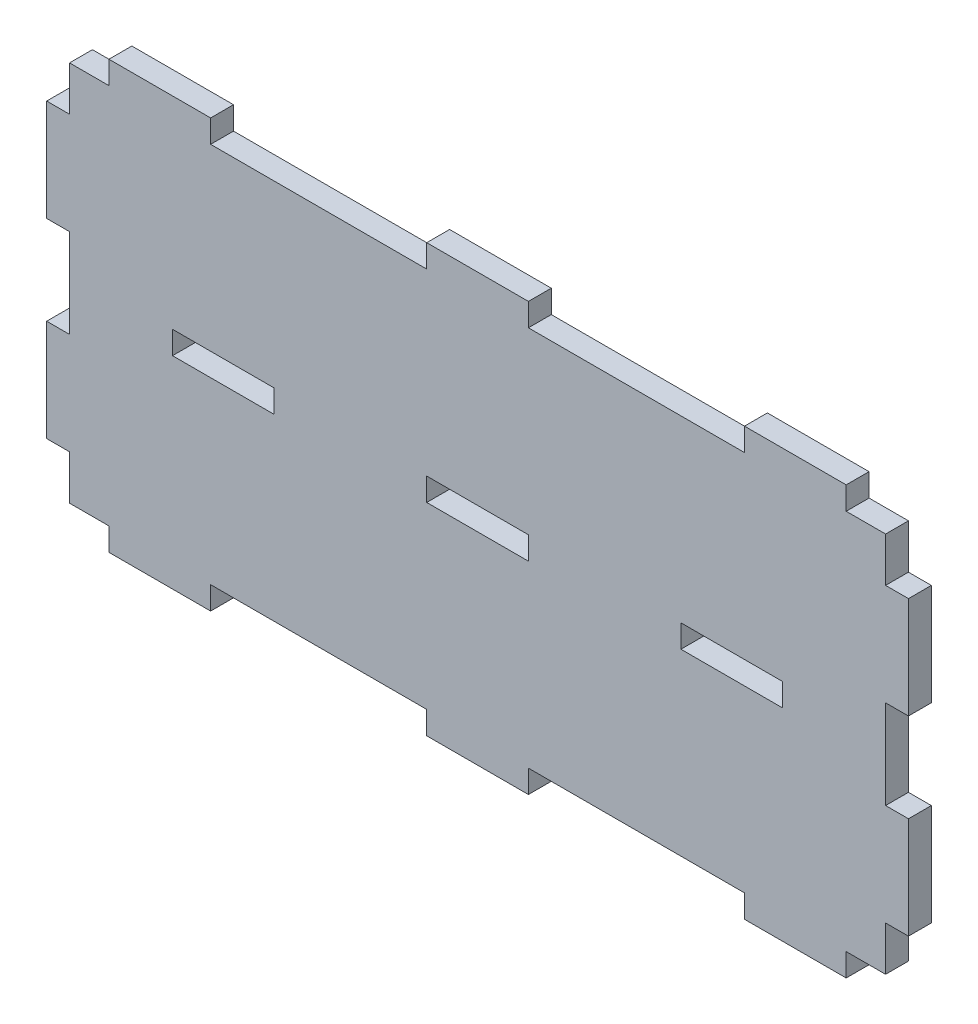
from build123d import *

# Parameters (mm, degrees)
SCHIZZO1_W                   = 642
SCHIZZO1_H                   = 300
ESTRUSIONE_ESTRUSIONE1_DEPTH = 18
SCHIZZO2_W                   = 80
SCHIZZO2_H                   = 18
ESTRUSIONE_ESTRUSIONE2_DEPTH = 18
SCHIZZO3_W                   = 18
SCHIZZO3_H                   = 80
ESTRUSIONE_ESTRUSIONE3_DEPTH = 18
SCHIZZO4_W                   = 80
SCHIZZO4_H                   = 18
TAGLIO_ESTRUSIONE1_DEPTH     = 379.773019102


with BuildPart() as part:
    # Schizzo1 → Estrusione-Estrusione1 (new body)
    with BuildSketch(Plane.XY):
        Rectangle(SCHIZZO1_W, SCHIZZO1_H)
    extrude(amount=ESTRUSIONE_ESTRUSIONE1_DEPTH)

    # Schizzo2 → Estrusione-Estrusione2 (add)
    with BuildSketch(Plane.XY.offset(18)):
        with Locations((-250, -159)):
            Rectangle(SCHIZZO2_W, SCHIZZO2_H)
        with Locations((250, -159)):
            Rectangle(SCHIZZO2_W, SCHIZZO2_H)
        with Locations((0, -159)):
            Rectangle(SCHIZZO2_W, SCHIZZO2_H)
        with Locations((0, 159)):
            Rectangle(SCHIZZO2_W, SCHIZZO2_H)
        with Locations((250, 159)):
            Rectangle(SCHIZZO2_W, SCHIZZO2_H)
        with Locations((-250, 159)):
            Rectangle(SCHIZZO2_W, SCHIZZO2_H)
    extrude(amount=-ESTRUSIONE_ESTRUSIONE2_DEPTH)

    # Schizzo3 → Estrusione-Estrusione3 (add)
    with BuildSketch(Plane.XY.offset(18)):
        with Locations((-330, 75)):
            Rectangle(SCHIZZO3_W, SCHIZZO3_H)
        with Locations((-330, -75)):
            Rectangle(SCHIZZO3_W, SCHIZZO3_H)
        with Locations((330, -75)):
            Rectangle(SCHIZZO3_W, SCHIZZO3_H)
        with Locations((330, 75)):
            Rectangle(SCHIZZO3_W, SCHIZZO3_H)
    extrude(amount=-ESTRUSIONE_ESTRUSIONE3_DEPTH)

    # Schizzo4 → Taglio-Estrusione1 (cut, through all)
    with BuildSketch(Plane.XY.offset(18)):
        Rectangle(SCHIZZO4_W, SCHIZZO4_H)
        with Locations((-200, 0)):
            Rectangle(SCHIZZO4_W, SCHIZZO4_H)
        with Locations((200, 0)):
            Rectangle(SCHIZZO4_W, SCHIZZO4_H)
    extrude(amount=-TAGLIO_ESTRUSIONE1_DEPTH, mode=Mode.SUBTRACT)


solid = part.part
